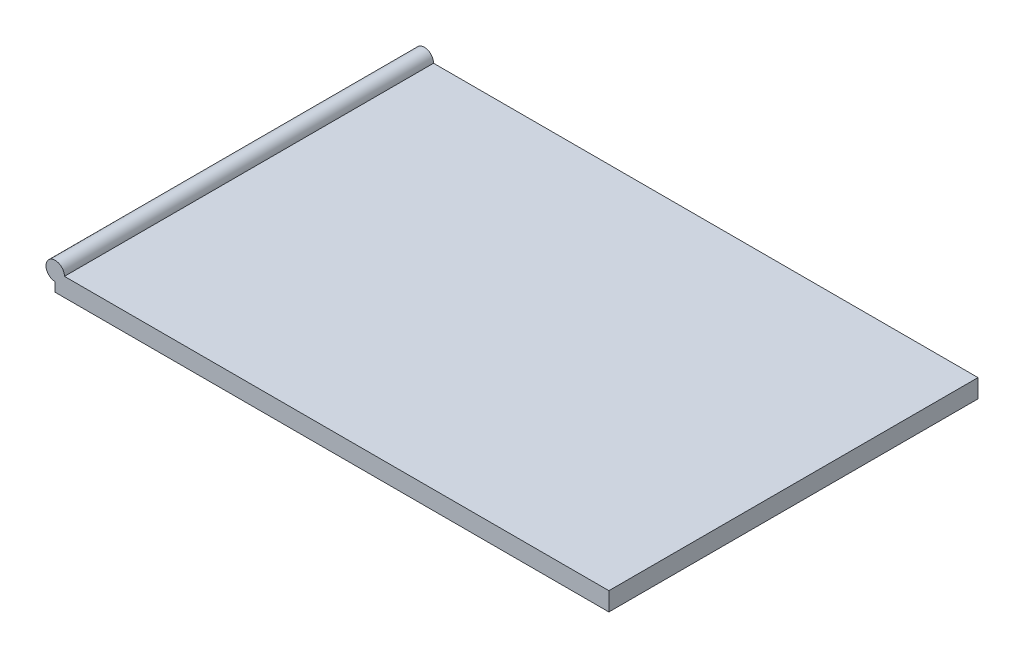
from build123d import *

# Parameters (mm, degrees)
ESQUISSE1_W        = 150
ESQUISSE1_H        = 5
BOSS_EXTRU_1_DEPTH = 50
ESQUISSE2_R        = 2.5
BOSS_EXTRU_2_DEPTH = 100


with BuildPart() as part:
    # Esquisse1 → Boss.-Extru.1 (new, symmetric)
    with BuildSketch(Plane.XY):
        with Locations((75, -2.5)):
            Rectangle(ESQUISSE1_W, ESQUISSE1_H)
    extrude(amount=BOSS_EXTRU_1_DEPTH, both=True)

    # Esquisse2 → Boss.-Extru.2 (add)
    with BuildSketch(Plane.XY.offset(50)):
        Circle(ESQUISSE2_R)
    extrude(amount=-BOSS_EXTRU_2_DEPTH)


solid = part.part
